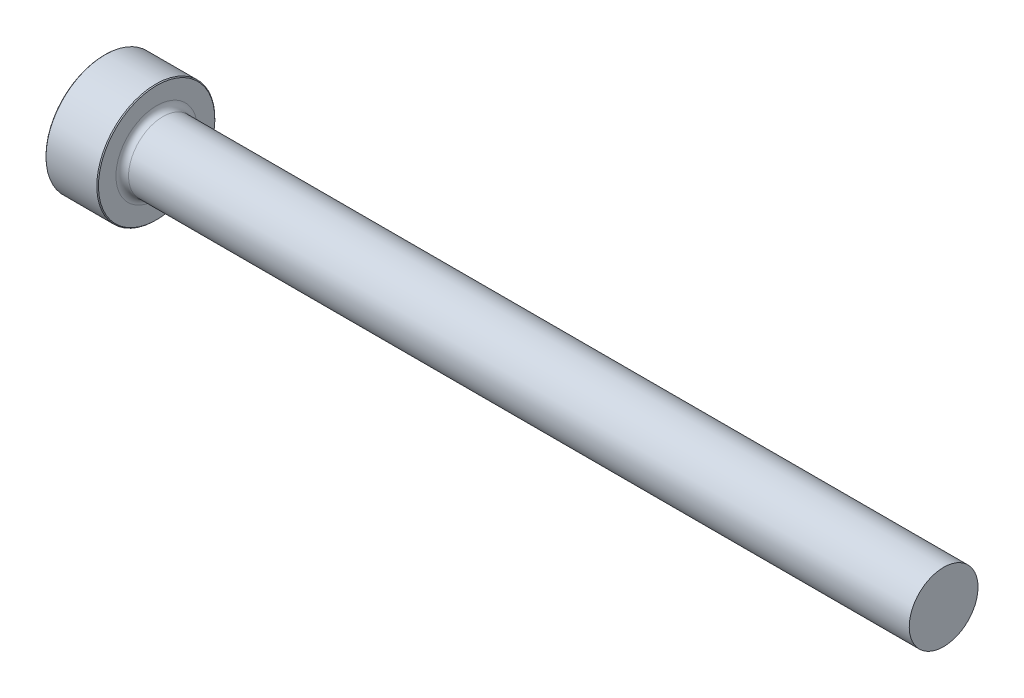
from build123d import *

# Parameters (mm, degrees)
CHAMFER1_SIZE = 0.1016


with BuildPart() as part:
    # Sketch1 → Revolve1 (revolve)
    with BuildSketch(Plane.XY):
        with BuildLine():
            Line((0, 0), (0, 7.14375))
            Line((0, 7.14375), (6.35, 7.14375))
            Line((6.35, 7.14375), (6.35, 4.9253775))
            ThreePointArc((6.35, 4.9253775), (6.573184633, 4.386562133), (7.112, 4.1633775))
            Line((7.112, 4.1633775), (101.6, 4.1633775))
            Line((101.6, 4.1633775), (101.6, 0))
            Line((101.6, 0), (0, 0))
        make_face()
    revolve(axis=Axis((101.6, 0, 0), (-1, 0, 0)))

    # Chamfer1
    chamfer1_edges = [part.edges().sort_by_distance(p)[0] for p in [
        (0, -7.14375, 0),
        (6.35, -7.14375, 0),
    ]]
    chamfer(chamfer1_edges, length=CHAMFER1_SIZE)


solid = part.part
